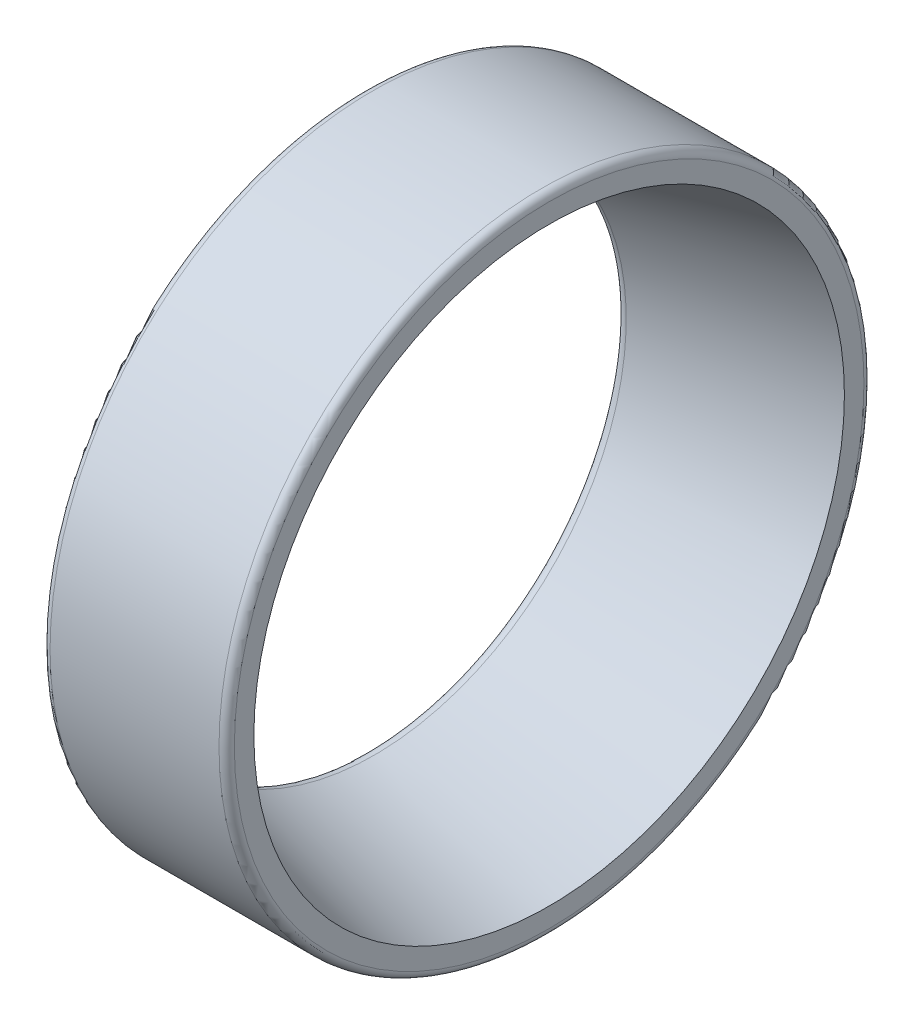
from build123d import *


with BuildPart() as part:
    # Esquisse1 → Base-R_volution (revolve)
    with BuildSketch(Plane(origin=(0, 0, 0), x_dir=(1, 0, 0), z_dir=(0, 1, 0)), mode=Mode.PRIVATE) as base_r_volution_sk:
        with BuildLine():
            Line((0, 16.887132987), (0, 20.5))
            ThreePointArc((0, 20.5), (0.146446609, 20.853553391), (0.5, 21))
            Line((0.5, 21), (11.5, 21))
            ThreePointArc((11.5, 21), (11.853553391, 20.853553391), (12, 20.5))
            Line((12, 20.5), (12, 19.229409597))
            Line((12, 19.229409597), (10.954879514, 18.969721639))
            Line((10.954879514, 18.969721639), (0.863194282, 16.462174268))
            Line((0.863194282, 16.462174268), (0.620571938, 16.401888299))
            ThreePointArc((0.620571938, 16.401888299), (0.192011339, 16.493251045), (0, 16.887132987))
        make_face()
    revolve(base_r_volution_sk.sketch.rotate(Axis((0, 0, 0), (1, 0, 0)), 180), axis=Axis((0, 0, 0), (1, 0, 0)))


solid = part.part
